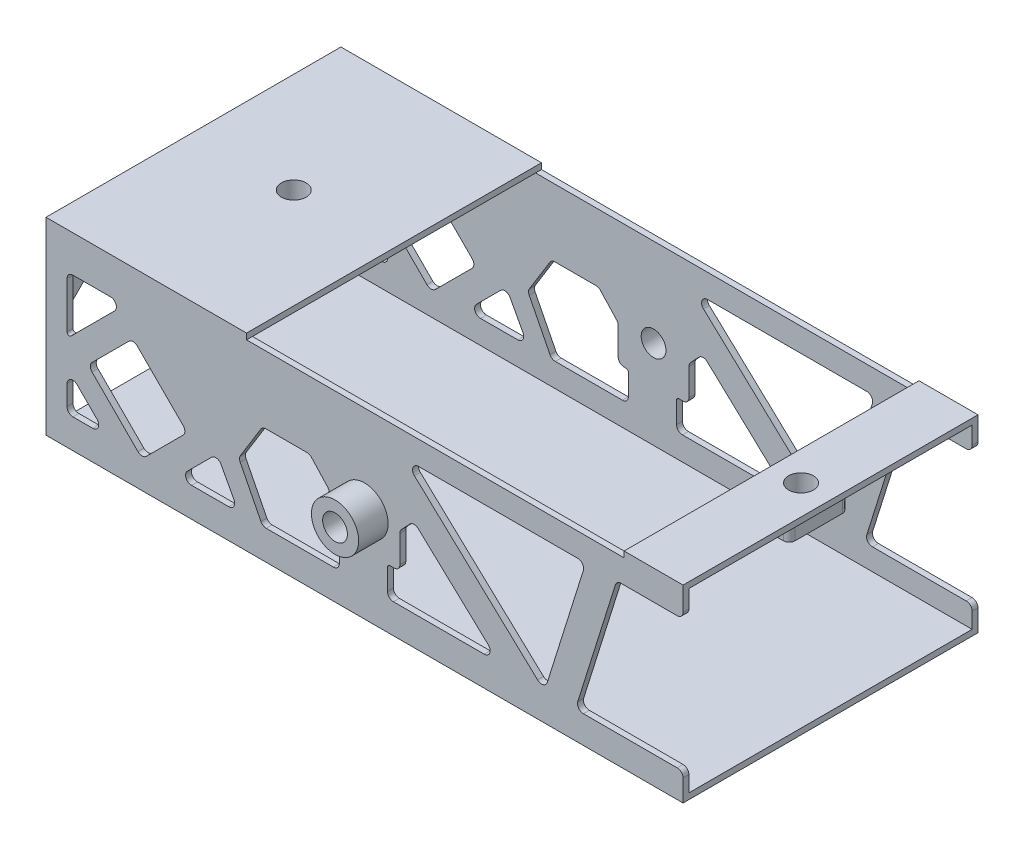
from build123d import *
from build123d.topology import SkipClean

# Parameters (mm, degrees)
SKETCH1_W           = 540
SKETCH1_H           = 250
BOSS_EXTRUDE1_DEPTH = 5
SKETCH2_R           = 10.5
BOSS_EXTRUDE2_DEPTH = 5
BOSS_EXTRUDE3_DEPTH = 5
SKETCH4_W           = 170
SKETCH4_H           = 250
SKETCH4_R           = 10.5
BOSS_EXTRUDE4_DEPTH = 5
SKETCH5_W           = 50
SKETCH5_H           = 250
SKETCH5_R           = 10.5
BOSS_EXTRUDE5_DEPTH = 5
FILLET1_R           = 5
FILLET2_R           = 2
SKETCH6_R           = 20
SKETCH6_R_2         = 10.5
BOSS_EXTRUDE6_DEPTH = 25
BOSS_EXTRUDE7_START = 25
SKETCH7_R           = 20
SKETCH7_R_2         = 10.5
BOSS_EXTRUDE7_DEPTH = 25
SKETCH8_W           = 60
SKETCH8_H           = 60
BOSS_EXTRUDE8_DEPTH = 10
FILLET3_R           = 5
CUT_EXTRUDE1_START  = -50
SKETCH9_R           = 10.5
CUT_EXTRUDE1_DEPTH  = 50
BOSS_EXTRUDE9_START = -25
SKETCH10_W          = 30
SKETCH10_H          = 50
SKETCH10_R          = 10.5
BOSS_EXTRUDE9_DEPTH = 25
FILLET4_R           = 5


with BuildPart() as part:
    # Sketch1 → Boss-Extrude1 (new body)
    with BuildSketch(Plane(origin=(0, 0, 0), x_dir=(1, 0, 0), z_dir=(0, 1, 0))):
        Rectangle(SKETCH1_W, SKETCH1_H)
    extrude(amount=BOSS_EXTRUDE1_DEPTH)

    # Sketch2 → Boss-Extrude2 (add)
    with BuildSketch(Plane.XY.offset(125)):
        Polygon((270, 23.324799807), (270, 5), (-270, 5), (-270, 155), (270, 155), (270, 135), (213.727448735, 135), (178.703027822, 23.324799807), align=None)
        with Locations((0, 80)):
            Circle(SKETCH2_R, mode=Mode.SUBTRACT)
        Polygon((-158.798320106, 24.881395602), (-106.686757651, 25), (-124.873343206, 58.806372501), align=None, mode=Mode.SUBTRACT)
        Polygon((-21.401719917, 50), (-30, 50), (-30, 80), (-46.522448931, 97.924168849), (-86.401719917, 97.924168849), (-106.686757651, 65.039738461), (-86.401719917, 25), (-21.401719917, 25), align=None, mode=Mode.SUBTRACT)
        Polygon((33.063967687, 135), (95.023635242, 77.067540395), (152.502333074, 23.324799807), (187.526753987, 135), align=None, mode=Mode.SUBTRACT)
        Polygon((114.105834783, 25), (19.44661778, 25), (19.44661778, 50), (30, 50), (30, 80), (41.792951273, 92.612745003), align=None, mode=Mode.SUBTRACT)
        Polygon((-150.239594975, 61.72439198), (-188.526392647, 23.437594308), (-197.575261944, 32.486463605), (-234.49198459, 69.403186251), (-196.205186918, 107.689983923), align=None, mode=Mode.SUBTRACT)
        Polygon((-252.179442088, 58.806372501), (-218.254465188, 24.881395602), (-252.179442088, 24.881395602), align=None, mode=Mode.SUBTRACT)
        Polygon((-252.179442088, 128.920346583), (-203.259095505, 128.920346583), (-252.179442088, 80), align=None, mode=Mode.SUBTRACT)
    boss_extrude2 = extrude(amount=-BOSS_EXTRUDE2_DEPTH)

    # Mirror1: Boss-Extrude2 across plane
    add(boss_extrude2.mirror(Plane.XY))

    # Sketch3 → Boss-Extrude3 (add)
    with BuildSketch(Plane.ZY.offset(270)):
        Polygon((-120, 155), (-45, 155), (-120, 80), align=None)
        Polygon((120, 155), (120, 80), (45, 155), align=None)
    extrude(amount=-BOSS_EXTRUDE3_DEPTH)

    # Sketch4 → Boss-Extrude4 (add)
    with BuildSketch(Plane(origin=(0, 155, 0), x_dir=(1, 0, 0), z_dir=(0, 1, 0))):
        with Locations((-185, 0)):
            Rectangle(SKETCH4_W, SKETCH4_H)
        with Locations(Location((-185, 0, 0), (0, 0, 270))):
            Circle(SKETCH4_R, mode=Mode.SUBTRACT)
    extrude(amount=BOSS_EXTRUDE4_DEPTH)

    # Sketch5 → Boss-Extrude5 (add)
    with BuildSketch(Plane(origin=(0, 155, 0), x_dir=(1, 0, 0), z_dir=(0, 1, 0))):
        with Locations((245, 0)):
            Rectangle(SKETCH5_W, SKETCH5_H)
        with Locations(Location((245, 0, 0), (0, 0, 270))):
            Circle(SKETCH5_R, mode=Mode.SUBTRACT)
    extrude(amount=BOSS_EXTRUDE5_DEPTH)

    # Fillet1
    fillet1_edges = [part.edges().sort_by_distance(p)[0] for p in [
        (-252.179442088, 128.920346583, -122.5),
        (-203.259095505, 128.920346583, -122.5),
        (-252.179442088, 58.806372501, -122.5),
        (-218.254465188, 24.881395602, -122.5),
        (-150.239594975, 61.72439198, -122.5),
        (-188.526392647, 23.437594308, -122.5),
        (-234.49198459, 69.403186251, -122.5),
        (114.105834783, 25, -122.5),
        (19.44661778, 25, -122.5),
        (30, 50, -122.5),
        (30, 80, -122.5),
        (152.502333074, 23.324799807, -122.5),
        (33.063967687, 135, -122.5),
        (270, 23.324799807, -122.5),
        (178.703027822, 23.324799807, -122.5),
        (213.727448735, 135, -122.5),
        (270, 135, -122.5),
        (-30, 50, -122.5),
        (-21.401719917, 25, -122.5),
        (-86.401719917, 25, -122.5),
        (-106.686757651, 65.039738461, -122.5),
        (-86.401719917, 97.924168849, -122.5),
        (-46.522448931, 97.924168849, -122.5),
        (-106.686757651, 25, -122.5),
        (-158.798320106, 24.881395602, -122.5),
        (-252.179442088, 24.881395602, -122.5),
        (-196.205186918, 107.689983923, -122.5),
        (41.792951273, 92.612745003, -122.5),
        (187.526753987, 135, -122.5),
        (-30, 80, -122.5),
        (-124.873343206, 58.806372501, -122.5),
        (-203.259095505, 128.920346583, 122.5),
        (-252.179442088, 128.920346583, 122.5),
        (-218.254465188, 24.881395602, 122.5),
        (-252.179442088, 58.806372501, 122.5),
        (-188.526392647, 23.437594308, 122.5),
        (-150.239594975, 61.72439198, 122.5),
        (-267.5, 80, -120),
        (-267.5, 155, -45),
        (-196.205186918, 107.689983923, 122.5),
        (19.44661778, 25, 122.5),
        (-267.5, 155, 45),
        (-267.5, 80, 120),
        (114.105834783, 25, 122.5),
        (41.792951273, 92.612745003, 122.5),
        (30, 80, 122.5),
        (30, 50, 122.5),
        (33.063967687, 135, 122.5),
        (152.502333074, 23.324799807, 122.5),
        (270, 23.324799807, 122.5),
        (270, 135, 122.5),
        (213.727448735, 135, 122.5),
        (-30, 50, 122.5),
        (-30, 80, 122.5),
        (-46.522448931, 97.924168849, 122.5),
        (-86.401719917, 97.924168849, 122.5),
        (-106.686757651, 65.039738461, 122.5),
        (-86.401719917, 25, 122.5),
        (-158.798320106, 24.881395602, 122.5),
        (-106.686757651, 25, 122.5),
        (-252.179442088, 24.881395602, 122.5),
        (-234.49198459, 69.403186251, 122.5),
        (187.526753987, 135, 122.5),
        (178.703027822, 23.324799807, 122.5),
        (-21.401719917, 25, 122.5),
        (-124.873343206, 58.806372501, 122.5),
    ]]
    fillet(fillet1_edges, radius=FILLET1_R)

    # Fillet2
    fillet2_edges = [part.edges().sort_by_distance(p)[0] for p in [
        (19.44661778, 50, -122.5),
        (-21.401719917, 50, -122.5),
        (-252.179442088, 80, -122.5),
        (-21.401719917, 50, 122.5),
        (19.44661778, 50, 122.5),
        (-252.179442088, 80, 122.5),
    ]]
    fillet(fillet2_edges, radius=FILLET2_R)

    # Sketch6 → Boss-Extrude6 (add)
    with BuildSketch(Plane(origin=(0, 0, -125), x_dir=(-1, 0, 0), z_dir=(0, 0, -1))):
        with Locations(Location((0, 80, 0), (0, 0, 180))):
            Circle(SKETCH6_R)
        with Locations(Location((0, 80, 0), (0, 0, 180))):
            Circle(SKETCH6_R_2, mode=Mode.SUBTRACT)
    boss_extrude6 = extrude(amount=BOSS_EXTRUDE6_DEPTH)

    # Mirror2: Boss-Extrude6 across plane
    add(boss_extrude6.mirror(Plane.XY))

    # Sketch7 → Boss-Extrude7 (add)
    with SkipClean():  # the faces are left unmerged after this step: merging them gives an invalid solid
        with BuildSketch(Plane.XZ.offset(-155).offset(BOSS_EXTRUDE7_START)):
            with Locations(Location((-185, 0, 0), (0, 0, 90))):
                Circle(SKETCH7_R)
            with Locations(Location((-185, 0, 0), (0, 0, 270))):
                Circle(SKETCH7_R_2, mode=Mode.SUBTRACT)
        extrude(amount=-BOSS_EXTRUDE7_DEPTH)

    # Sketch8 → Boss-Extrude8 (add)
    with BuildSketch(Plane(origin=(0, 160, 0), x_dir=(1, 0, 0), z_dir=(0, 1, 0))):
        with Locations((-185, 0)):
            Rectangle(SKETCH8_W, SKETCH8_H)
    extrude(amount=-BOSS_EXTRUDE8_DEPTH)

    # Fillet3
    fillet3_edges = [part.edges().sort_by_distance(p)[0] for p in [
        (-215, 152.5, 30),
        (-215, 152.5, -30),
        (-155, 152.5, -30),
        (-155, 152.5, 30),
    ]]
    fillet(fillet3_edges, radius=FILLET3_R)

    # Sketch9 → Cut-Extrude1 (cut)
    with BuildSketch(Plane(origin=(0, 160, 0), x_dir=(1, 0, 0), z_dir=(0, 1, 0)).offset(CUT_EXTRUDE1_START)):
        with Locations(Location((-185, 0, 0), (0, 0, 90))):
            Circle(SKETCH9_R)
    extrude(amount=CUT_EXTRUDE1_DEPTH, mode=Mode.SUBTRACT)

    # Sketch10 → Boss-Extrude9 (add)
    with BuildSketch(Plane(origin=(0, 160, 0), x_dir=(1, 0, 0), z_dir=(0, 1, 0)).offset(BOSS_EXTRUDE9_START)):
        with Locations((245, 0)):
            Rectangle(SKETCH10_W, SKETCH10_H)
        with Locations(Location((245, 0, 0), (0, 0, 270))):
            Circle(SKETCH10_R, mode=Mode.SUBTRACT)
    extrude(amount=BOSS_EXTRUDE9_DEPTH)

    # Fillet4
    fillet4_edges = [part.edges().sort_by_distance(p)[0] for p in [
        (230, 145, 25),
        (230, 145, -25),
        (260, 145, -25),
        (260, 145, 25),
    ]]
    fillet(fillet4_edges, radius=FILLET4_R)


solid = part.part
